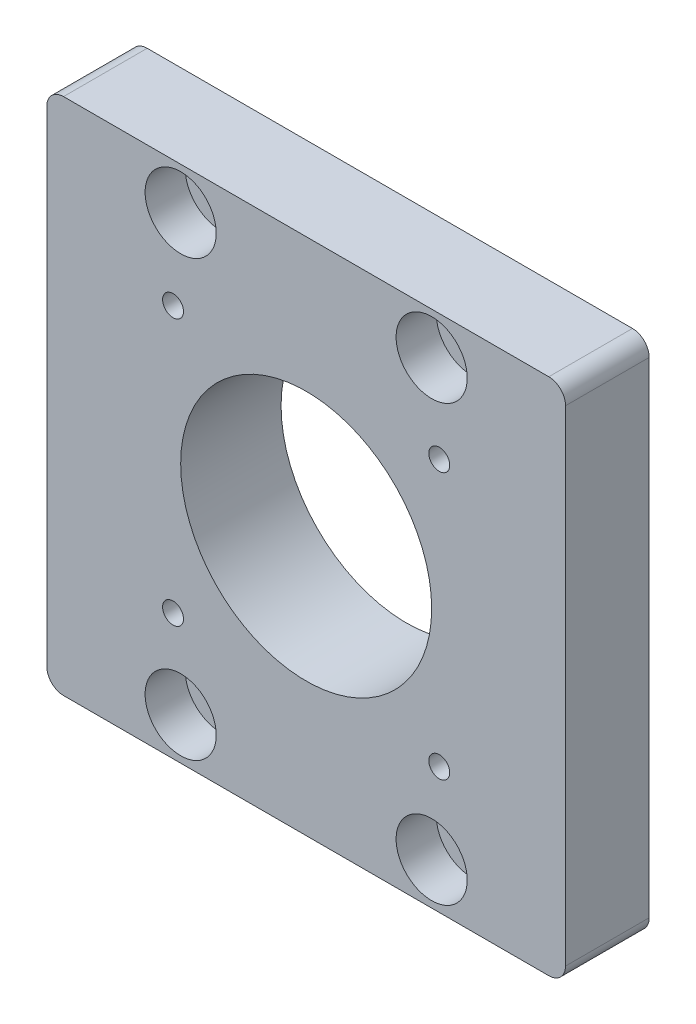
ISO-10303-21;
HEADER;
FILE_DESCRIPTION(('STEP AP214'),'2;1');
FILE_NAME('part.step','',(''),(''),'','','');
FILE_SCHEMA(('AUTOMOTIVE_DESIGN { 1 0 10303 214 1 1 1 1 }'));
ENDSEC;
DATA;
#1=APPLICATION_CONTEXT('core data for automotive mechanical design processes');
#2=APPLICATION_PROTOCOL_DEFINITION('international standard','automotive_design',2000,#1);
#3=PRODUCT_CONTEXT('',#1,'mechanical');
#4=PRODUCT('Part','Part','',(#3));
#5=PRODUCT_RELATED_PRODUCT_CATEGORY('part','',(#4));
#6=PRODUCT_DEFINITION_FORMATION('','',#4);
#7=PRODUCT_DEFINITION_CONTEXT('part definition',#1,'design');
#8=PRODUCT_DEFINITION('design','',#6,#7);
#9=PRODUCT_DEFINITION_SHAPE('','',#8);
#10=(LENGTH_UNIT() NAMED_UNIT(*) SI_UNIT(.MILLI.,.METRE.));
#11=(NAMED_UNIT(*) PLANE_ANGLE_UNIT() SI_UNIT($,.RADIAN.));
#12=(NAMED_UNIT(*) SI_UNIT($,.STERADIAN.) SOLID_ANGLE_UNIT());
#13=UNCERTAINTY_MEASURE_WITH_UNIT(LENGTH_MEASURE(1.E-05),#10,'distance_accuracy_value','');
#14=(GEOMETRIC_REPRESENTATION_CONTEXT(3) GLOBAL_UNCERTAINTY_ASSIGNED_CONTEXT((#13)) GLOBAL_UNIT_ASSIGNED_CONTEXT((#10,
#11,#12)) REPRESENTATION_CONTEXT('',''));
#15=CARTESIAN_POINT('',(0.,0.,0.));
#16=DIRECTION('',(0.,0.,1.));
#17=DIRECTION('',(1.,0.,0.));
#18=AXIS2_PLACEMENT_3D('',#15,#16,#17);
#19=CARTESIAN_POINT('',(0.,0.,0.));
#20=DIRECTION('',(0.,0.,-1.));
#21=DIRECTION('',(-1.,0.,0.));
#22=AXIS2_PLACEMENT_3D('',#19,#20,#21);
#23=PLANE('',#22);
#24=DIRECTION('',(0.,-1.,0.));
#25=VECTOR('',#24,1.);
#26=CARTESIAN_POINT('',(-31.,-31.,0.));
#27=LINE('',#26,#25);
#28=CARTESIAN_POINT('',(-31.,29.,0.));
#29=VERTEX_POINT('',#28);
#30=CARTESIAN_POINT('',(-31.,-29.,0.));
#31=VERTEX_POINT('',#30);
#32=EDGE_CURVE('E126',#29,#31,#27,.T.);
#33=ORIENTED_EDGE('',*,*,#32,.F.);
#34=CARTESIAN_POINT('',(-29.,29.,0.));
#35=DIRECTION('',(0.,0.,-1.));
#36=DIRECTION('',(-1.,0.,0.));
#37=AXIS2_PLACEMENT_3D('',#34,#35,#36);
#38=CIRCLE('',#37,2.);
#39=CARTESIAN_POINT('',(-29.,31.,0.));
#40=VERTEX_POINT('',#39);
#41=EDGE_CURVE('E108',#29,#40,#38,.T.);
#42=ORIENTED_EDGE('',*,*,#41,.T.);
#43=DIRECTION('',(-1.,0.,0.));
#44=VECTOR('',#43,1.);
#45=CARTESIAN_POINT('',(-31.,31.,0.));
#46=LINE('',#45,#44);
#47=CARTESIAN_POINT('',(29.,31.,0.));
#48=VERTEX_POINT('',#47);
#49=EDGE_CURVE('E137',#48,#40,#46,.T.);
#50=ORIENTED_EDGE('',*,*,#49,.F.);
#51=CARTESIAN_POINT('',(29.,29.,0.));
#52=DIRECTION('',(0.,0.,-1.));
#53=DIRECTION('',(-1.,0.,0.));
#54=AXIS2_PLACEMENT_3D('',#51,#52,#53);
#55=CIRCLE('',#54,2.);
#56=CARTESIAN_POINT('',(31.,29.,0.));
#57=VERTEX_POINT('',#56);
#58=EDGE_CURVE('E130',#48,#57,#55,.T.);
#59=ORIENTED_EDGE('',*,*,#58,.T.);
#60=DIRECTION('',(0.,1.,0.));
#61=VECTOR('',#60,1.);
#62=CARTESIAN_POINT('',(31.,-31.,0.));
#63=LINE('',#62,#61);
#64=CARTESIAN_POINT('',(31.,-29.,0.));
#65=VERTEX_POINT('',#64);
#66=EDGE_CURVE('E145',#65,#57,#63,.T.);
#67=ORIENTED_EDGE('',*,*,#66,.F.);
#68=CARTESIAN_POINT('',(29.,-29.,0.));
#69=DIRECTION('',(0.,0.,-1.));
#70=DIRECTION('',(-1.,0.,0.));
#71=AXIS2_PLACEMENT_3D('',#68,#69,#70);
#72=CIRCLE('',#71,2.);
#73=CARTESIAN_POINT('',(29.,-31.,0.));
#74=VERTEX_POINT('',#73);
#75=EDGE_CURVE('E178',#65,#74,#72,.T.);
#76=ORIENTED_EDGE('',*,*,#75,.T.);
#77=DIRECTION('',(1.,0.,0.));
#78=VECTOR('',#77,1.);
#79=CARTESIAN_POINT('',(-31.,-31.,0.));
#80=LINE('',#79,#78);
#81=CARTESIAN_POINT('',(-29.,-31.,0.));
#82=VERTEX_POINT('',#81);
#83=EDGE_CURVE('E136',#82,#74,#80,.T.);
#84=ORIENTED_EDGE('',*,*,#83,.F.);
#85=CARTESIAN_POINT('',(-29.,-29.,0.));
#86=DIRECTION('',(0.,0.,-1.));
#87=DIRECTION('',(-1.,0.,0.));
#88=AXIS2_PLACEMENT_3D('',#85,#86,#87);
#89=CIRCLE('',#88,2.);
#90=EDGE_CURVE('E120',#82,#31,#89,.T.);
#91=ORIENTED_EDGE('',*,*,#90,.T.);
#92=EDGE_LOOP('',(#33,#42,#50,#59,#67,#76,#84,#91));
#93=FACE_BOUND('',#92,.T.);
#94=CARTESIAN_POINT('',(-15.,25.9807621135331,0.));
#95=DIRECTION('',(0.,0.,1.));
#96=DIRECTION('',(1.,0.,0.));
#97=AXIS2_PLACEMENT_3D('',#94,#95,#96);
#98=CIRCLE('',#97,2.25);
#99=CARTESIAN_POINT('',(-12.75,25.9807621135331,0.));
#100=VERTEX_POINT('',#99);
#101=EDGE_CURVE('E267',#100,#100,#98,.T.);
#102=ORIENTED_EDGE('',*,*,#101,.T.);
#103=EDGE_LOOP('',(#102));
#104=FACE_BOUND('',#103,.T.);
#105=CARTESIAN_POINT('',(15.,25.9807621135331,0.));
#106=DIRECTION('',(0.,0.,1.));
#107=DIRECTION('',(1.,0.,0.));
#108=AXIS2_PLACEMENT_3D('',#105,#106,#107);
#109=CIRCLE('',#108,2.25);
#110=CARTESIAN_POINT('',(17.25,25.9807621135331,0.));
#111=VERTEX_POINT('',#110);
#112=EDGE_CURVE('E274',#111,#111,#109,.T.);
#113=ORIENTED_EDGE('',*,*,#112,.T.);
#114=EDGE_LOOP('',(#113));
#115=FACE_BOUND('',#114,.T.);
#116=CARTESIAN_POINT('',(15.,-25.9807621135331,0.));
#117=DIRECTION('',(0.,0.,1.));
#118=DIRECTION('',(1.,0.,0.));
#119=AXIS2_PLACEMENT_3D('',#116,#117,#118);
#120=CIRCLE('',#119,2.25);
#121=CARTESIAN_POINT('',(17.25,-25.9807621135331,0.));
#122=VERTEX_POINT('',#121);
#123=EDGE_CURVE('E278',#122,#122,#120,.T.);
#124=ORIENTED_EDGE('',*,*,#123,.T.);
#125=EDGE_LOOP('',(#124));
#126=FACE_BOUND('',#125,.T.);
#127=CARTESIAN_POINT('',(-15.,-25.9807621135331,0.));
#128=DIRECTION('',(0.,0.,1.));
#129=DIRECTION('',(1.,0.,0.));
#130=AXIS2_PLACEMENT_3D('',#127,#128,#129);
#131=CIRCLE('',#130,2.25);
#132=CARTESIAN_POINT('',(-12.75,-25.9807621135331,0.));
#133=VERTEX_POINT('',#132);
#134=EDGE_CURVE('E153',#133,#133,#131,.T.);
#135=ORIENTED_EDGE('',*,*,#134,.T.);
#136=EDGE_LOOP('',(#135));
#137=FACE_BOUND('',#136,.T.);
#138=CARTESIAN_POINT('',(0.,0.,0.));
#139=DIRECTION('',(0.,0.,-1.));
#140=DIRECTION('',(-1.,0.,0.));
#141=AXIS2_PLACEMENT_3D('',#138,#139,#140);
#142=CIRCLE('',#141,25.);
#143=CARTESIAN_POINT('',(-25.,0.,0.));
#144=VERTEX_POINT('',#143);
#145=EDGE_CURVE('E309',#144,#144,#142,.T.);
#146=ORIENTED_EDGE('',*,*,#145,.F.);
#147=EDGE_LOOP('',(#146));
#148=FACE_BOUND('',#147,.T.);
#149=ADVANCED_FACE('F40',(#93,#104,#115,#126,#137,#148),#23,.T.);
#150=CARTESIAN_POINT('',(-15.,-25.9807621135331,0.));
#151=DIRECTION('',(0.,0.,1.));
#152=DIRECTION('',(1.,0.,0.));
#153=AXIS2_PLACEMENT_3D('',#150,#151,#152);
#154=CYLINDRICAL_SURFACE('',#153,2.25);
#155=ORIENTED_EDGE('',*,*,#134,.F.);
#156=EDGE_LOOP('',(#155));
#157=FACE_BOUND('',#156,.T.);
#158=CARTESIAN_POINT('',(-15.,-25.9807621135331,5.2));
#159=DIRECTION('',(0.,0.,1.));
#160=DIRECTION('',(1.,0.,0.));
#161=AXIS2_PLACEMENT_3D('',#158,#159,#160);
#162=CIRCLE('',#161,2.25);
#163=CARTESIAN_POINT('',(-12.75,-25.9807621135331,5.2));
#164=VERTEX_POINT('',#163);
#165=EDGE_CURVE('E167',#164,#164,#162,.F.);
#166=ORIENTED_EDGE('',*,*,#165,.F.);
#167=EDGE_LOOP('',(#166));
#168=FACE_BOUND('',#167,.T.);
#169=ADVANCED_FACE('F340',(#157,#168),#154,.F.);
#170=CARTESIAN_POINT('',(15.,-25.9807621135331,0.));
#171=DIRECTION('',(0.,0.,1.));
#172=DIRECTION('',(1.,0.,0.));
#173=AXIS2_PLACEMENT_3D('',#170,#171,#172);
#174=CYLINDRICAL_SURFACE('',#173,2.25);
#175=ORIENTED_EDGE('',*,*,#123,.F.);
#176=EDGE_LOOP('',(#175));
#177=FACE_BOUND('',#176,.T.);
#178=CARTESIAN_POINT('',(15.,-25.9807621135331,5.2));
#179=DIRECTION('',(0.,0.,1.));
#180=DIRECTION('',(1.,0.,0.));
#181=AXIS2_PLACEMENT_3D('',#178,#179,#180);
#182=CIRCLE('',#181,2.25);
#183=CARTESIAN_POINT('',(17.25,-25.9807621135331,5.2));
#184=VERTEX_POINT('',#183);
#185=EDGE_CURVE('E161',#184,#184,#182,.F.);
#186=ORIENTED_EDGE('',*,*,#185,.F.);
#187=EDGE_LOOP('',(#186));
#188=FACE_BOUND('',#187,.T.);
#189=ADVANCED_FACE('F345',(#177,#188),#174,.F.);
#190=CARTESIAN_POINT('',(15.,25.9807621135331,0.));
#191=DIRECTION('',(0.,0.,1.));
#192=DIRECTION('',(1.,0.,0.));
#193=AXIS2_PLACEMENT_3D('',#190,#191,#192);
#194=CYLINDRICAL_SURFACE('',#193,2.25);
#195=ORIENTED_EDGE('',*,*,#112,.F.);
#196=EDGE_LOOP('',(#195));
#197=FACE_BOUND('',#196,.T.);
#198=CARTESIAN_POINT('',(15.,25.9807621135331,5.2));
#199=DIRECTION('',(0.,0.,1.));
#200=DIRECTION('',(1.,0.,0.));
#201=AXIS2_PLACEMENT_3D('',#198,#199,#200);
#202=CIRCLE('',#201,2.25);
#203=CARTESIAN_POINT('',(17.25,25.9807621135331,5.2));
#204=VERTEX_POINT('',#203);
#205=EDGE_CURVE('E155',#204,#204,#202,.F.);
#206=ORIENTED_EDGE('',*,*,#205,.F.);
#207=EDGE_LOOP('',(#206));
#208=FACE_BOUND('',#207,.T.);
#209=ADVANCED_FACE('F416',(#197,#208),#194,.F.);
#210=CARTESIAN_POINT('',(-15.,25.9807621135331,0.));
#211=DIRECTION('',(0.,0.,1.));
#212=DIRECTION('',(1.,0.,0.));
#213=AXIS2_PLACEMENT_3D('',#210,#211,#212);
#214=CYLINDRICAL_SURFACE('',#213,2.25);
#215=ORIENTED_EDGE('',*,*,#101,.F.);
#216=EDGE_LOOP('',(#215));
#217=FACE_BOUND('',#216,.T.);
#218=CARTESIAN_POINT('',(-15.,25.9807621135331,5.2));
#219=DIRECTION('',(0.,0.,1.));
#220=DIRECTION('',(1.,0.,0.));
#221=AXIS2_PLACEMENT_3D('',#218,#219,#220);
#222=CIRCLE('',#221,2.25);
#223=CARTESIAN_POINT('',(-12.75,25.9807621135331,5.2));
#224=VERTEX_POINT('',#223);
#225=EDGE_CURVE('E149',#224,#224,#222,.F.);
#226=ORIENTED_EDGE('',*,*,#225,.F.);
#227=EDGE_LOOP('',(#226));
#228=FACE_BOUND('',#227,.T.);
#229=ADVANCED_FACE('F420',(#217,#228),#214,.F.);
#230=CARTESIAN_POINT('',(0.,0.,10.));
#231=DIRECTION('',(0.,0.,-1.));
#232=DIRECTION('',(-1.,0.,0.));
#233=AXIS2_PLACEMENT_3D('',#230,#231,#232);
#234=PLANE('',#233);
#235=CARTESIAN_POINT('',(-15.,-25.9807621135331,10.));
#236=DIRECTION('',(0.,0.,1.));
#237=DIRECTION('',(1.,0.,0.));
#238=AXIS2_PLACEMENT_3D('',#235,#236,#237);
#239=CIRCLE('',#238,4.25);
#240=CARTESIAN_POINT('',(-10.75,-25.9807621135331,10.));
#241=VERTEX_POINT('',#240);
#242=EDGE_CURVE('E301',#241,#241,#239,.T.);
#243=ORIENTED_EDGE('',*,*,#242,.F.);
#244=EDGE_LOOP('',(#243));
#245=FACE_BOUND('',#244,.T.);
#246=CARTESIAN_POINT('',(15.,-25.9807621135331,10.));
#247=DIRECTION('',(0.,0.,1.));
#248=DIRECTION('',(1.,0.,0.));
#249=AXIS2_PLACEMENT_3D('',#246,#247,#248);
#250=CIRCLE('',#249,4.25);
#251=CARTESIAN_POINT('',(19.25,-25.9807621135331,10.));
#252=VERTEX_POINT('',#251);
#253=EDGE_CURVE('E171',#252,#252,#250,.T.);
#254=ORIENTED_EDGE('',*,*,#253,.F.);
#255=EDGE_LOOP('',(#254));
#256=FACE_BOUND('',#255,.T.);
#257=CARTESIAN_POINT('',(15.,25.9807621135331,10.));
#258=DIRECTION('',(0.,0.,1.));
#259=DIRECTION('',(1.,0.,0.));
#260=AXIS2_PLACEMENT_3D('',#257,#258,#259);
#261=CIRCLE('',#260,4.25);
#262=CARTESIAN_POINT('',(19.25,25.9807621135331,10.));
#263=VERTEX_POINT('',#262);
#264=EDGE_CURVE('E165',#263,#263,#261,.T.);
#265=ORIENTED_EDGE('',*,*,#264,.F.);
#266=EDGE_LOOP('',(#265));
#267=FACE_BOUND('',#266,.T.);
#268=CARTESIAN_POINT('',(-15.,25.9807621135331,10.));
#269=DIRECTION('',(0.,0.,1.));
#270=DIRECTION('',(1.,0.,0.));
#271=AXIS2_PLACEMENT_3D('',#268,#269,#270);
#272=CIRCLE('',#271,4.25);
#273=CARTESIAN_POINT('',(-10.75,25.9807621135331,10.));
#274=VERTEX_POINT('',#273);
#275=EDGE_CURVE('E159',#274,#274,#272,.T.);
#276=ORIENTED_EDGE('',*,*,#275,.F.);
#277=EDGE_LOOP('',(#276));
#278=FACE_BOUND('',#277,.T.);
#279=CARTESIAN_POINT('',(-15.9099025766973,-15.9099025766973,10.));
#280=DIRECTION('',(0.,0.,1.));
#281=DIRECTION('',(1.,0.,0.));
#282=AXIS2_PLACEMENT_3D('',#279,#280,#281);
#283=CIRCLE('',#282,1.25);
#284=CARTESIAN_POINT('',(-14.6599025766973,-15.9099025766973,10.));
#285=VERTEX_POINT('',#284);
#286=EDGE_CURVE('E263',#285,#285,#283,.T.);
#287=ORIENTED_EDGE('',*,*,#286,.F.);
#288=EDGE_LOOP('',(#287));
#289=FACE_BOUND('',#288,.T.);
#290=CARTESIAN_POINT('',(15.9099025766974,-15.9099025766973,10.));
#291=DIRECTION('',(0.,0.,1.));
#292=DIRECTION('',(1.,0.,0.));
#293=AXIS2_PLACEMENT_3D('',#290,#291,#292);
#294=CIRCLE('',#293,1.25);
#295=CARTESIAN_POINT('',(17.1599025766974,-15.9099025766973,10.));
#296=VERTEX_POINT('',#295);
#297=EDGE_CURVE('E255',#296,#296,#294,.T.);
#298=ORIENTED_EDGE('',*,*,#297,.F.);
#299=EDGE_LOOP('',(#298));
#300=FACE_BOUND('',#299,.T.);
#301=CARTESIAN_POINT('',(15.9099025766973,15.9099025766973,10.));
#302=DIRECTION('',(0.,0.,1.));
#303=DIRECTION('',(1.,0.,0.));
#304=AXIS2_PLACEMENT_3D('',#301,#302,#303);
#305=CIRCLE('',#304,1.25);
#306=CARTESIAN_POINT('',(17.1599025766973,15.9099025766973,10.));
#307=VERTEX_POINT('',#306);
#308=EDGE_CURVE('E248',#307,#307,#305,.T.);
#309=ORIENTED_EDGE('',*,*,#308,.F.);
#310=EDGE_LOOP('',(#309));
#311=FACE_BOUND('',#310,.T.);
#312=CARTESIAN_POINT('',(-15.9099025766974,15.9099025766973,10.));
#313=DIRECTION('',(0.,0.,1.));
#314=DIRECTION('',(1.,0.,0.));
#315=AXIS2_PLACEMENT_3D('',#312,#313,#314);
#316=CIRCLE('',#315,1.25);
#317=CARTESIAN_POINT('',(-14.6599025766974,15.9099025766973,10.));
#318=VERTEX_POINT('',#317);
#319=EDGE_CURVE('E240',#318,#318,#316,.T.);
#320=ORIENTED_EDGE('',*,*,#319,.F.);
#321=EDGE_LOOP('',(#320));
#322=FACE_BOUND('',#321,.T.);
#323=DIRECTION('',(-1.,0.,0.));
#324=VECTOR('',#323,1.);
#325=CARTESIAN_POINT('',(-31.,31.,10.));
#326=LINE('',#325,#324);
#327=CARTESIAN_POINT('',(29.,31.,10.));
#328=VERTEX_POINT('',#327);
#329=CARTESIAN_POINT('',(-29.,31.,10.));
#330=VERTEX_POINT('',#329);
#331=EDGE_CURVE('E223',#328,#330,#326,.T.);
#332=ORIENTED_EDGE('',*,*,#331,.T.);
#333=CARTESIAN_POINT('',(-29.,29.,10.));
#334=DIRECTION('',(0.,0.,-1.));
#335=DIRECTION('',(-1.,0.,0.));
#336=AXIS2_PLACEMENT_3D('',#333,#334,#335);
#337=CIRCLE('',#336,2.);
#338=CARTESIAN_POINT('',(-31.,29.,10.));
#339=VERTEX_POINT('',#338);
#340=EDGE_CURVE('E196',#330,#339,#337,.F.);
#341=ORIENTED_EDGE('',*,*,#340,.T.);
#342=DIRECTION('',(0.,-1.,0.));
#343=VECTOR('',#342,1.);
#344=CARTESIAN_POINT('',(-31.,-31.,10.));
#345=LINE('',#344,#343);
#346=CARTESIAN_POINT('',(-31.,-29.,10.));
#347=VERTEX_POINT('',#346);
#348=EDGE_CURVE('E128',#339,#347,#345,.T.);
#349=ORIENTED_EDGE('',*,*,#348,.T.);
#350=CARTESIAN_POINT('',(-29.,-29.,10.));
#351=DIRECTION('',(0.,0.,-1.));
#352=DIRECTION('',(-1.,0.,0.));
#353=AXIS2_PLACEMENT_3D('',#350,#351,#352);
#354=CIRCLE('',#353,2.);
#355=CARTESIAN_POINT('',(-29.,-31.,10.));
#356=VERTEX_POINT('',#355);
#357=EDGE_CURVE('E63',#347,#356,#354,.F.);
#358=ORIENTED_EDGE('',*,*,#357,.T.);
#359=DIRECTION('',(1.,0.,0.));
#360=VECTOR('',#359,1.);
#361=CARTESIAN_POINT('',(-31.,-31.,10.));
#362=LINE('',#361,#360);
#363=CARTESIAN_POINT('',(29.,-31.,10.));
#364=VERTEX_POINT('',#363);
#365=EDGE_CURVE('E174',#356,#364,#362,.T.);
#366=ORIENTED_EDGE('',*,*,#365,.T.);
#367=CARTESIAN_POINT('',(29.,-29.,10.));
#368=DIRECTION('',(0.,0.,-1.));
#369=DIRECTION('',(-1.,0.,0.));
#370=AXIS2_PLACEMENT_3D('',#367,#368,#369);
#371=CIRCLE('',#370,2.);
#372=CARTESIAN_POINT('',(31.,-29.,10.));
#373=VERTEX_POINT('',#372);
#374=EDGE_CURVE('E191',#364,#373,#371,.F.);
#375=ORIENTED_EDGE('',*,*,#374,.T.);
#376=DIRECTION('',(0.,1.,0.));
#377=VECTOR('',#376,1.);
#378=CARTESIAN_POINT('',(31.,-31.,10.));
#379=LINE('',#378,#377);
#380=CARTESIAN_POINT('',(31.,29.,10.));
#381=VERTEX_POINT('',#380);
#382=EDGE_CURVE('E142',#373,#381,#379,.T.);
#383=ORIENTED_EDGE('',*,*,#382,.T.);
#384=CARTESIAN_POINT('',(29.,29.,10.));
#385=DIRECTION('',(0.,0.,-1.));
#386=DIRECTION('',(-1.,0.,0.));
#387=AXIS2_PLACEMENT_3D('',#384,#385,#386);
#388=CIRCLE('',#387,2.);
#389=EDGE_CURVE('E188',#381,#328,#388,.F.);
#390=ORIENTED_EDGE('',*,*,#389,.T.);
#391=EDGE_LOOP('',(#332,#341,#349,#358,#366,#375,#383,#390));
#392=FACE_BOUND('',#391,.T.);
#393=CARTESIAN_POINT('',(0.,0.,10.));
#394=DIRECTION('',(0.,0.,1.));
#395=DIRECTION('',(1.,0.,0.));
#396=AXIS2_PLACEMENT_3D('',#393,#394,#395);
#397=CIRCLE('',#396,15.);
#398=CARTESIAN_POINT('',(15.,0.,10.));
#399=VERTEX_POINT('',#398);
#400=EDGE_CURVE('E229',#399,#399,#397,.T.);
#401=ORIENTED_EDGE('',*,*,#400,.F.);
#402=EDGE_LOOP('',(#401));
#403=FACE_BOUND('',#402,.T.);
#404=ADVANCED_FACE('F218',(#245,#256,#267,#278,#289,#300,#311,#322,#392,#403),#234,.F.);
#405=CARTESIAN_POINT('',(31.,-31.,10.));
#406=DIRECTION('',(-1.,0.,0.));
#407=DIRECTION('',(0.,0.,1.));
#408=AXIS2_PLACEMENT_3D('',#405,#406,#407);
#409=PLANE('',#408);
#410=ORIENTED_EDGE('',*,*,#382,.F.);
#411=DIRECTION('',(0.,0.,-1.));
#412=VECTOR('',#411,1.);
#413=CARTESIAN_POINT('',(31.,-29.,10.));
#414=LINE('',#413,#412);
#415=EDGE_CURVE('E11',#373,#65,#414,.T.);
#416=ORIENTED_EDGE('',*,*,#415,.T.);
#417=ORIENTED_EDGE('',*,*,#66,.T.);
#418=DIRECTION('',(0.,0.,-1.));
#419=VECTOR('',#418,1.);
#420=CARTESIAN_POINT('',(31.,29.,10.));
#421=LINE('',#420,#419);
#422=EDGE_CURVE('E49',#57,#381,#421,.F.);
#423=ORIENTED_EDGE('',*,*,#422,.T.);
#424=EDGE_LOOP('',(#410,#416,#417,#423));
#425=FACE_BOUND('',#424,.T.);
#426=ADVANCED_FACE('F212',(#425),#409,.F.);
#427=CARTESIAN_POINT('',(-31.,31.,10.));
#428=DIRECTION('',(0.,-1.,0.));
#429=DIRECTION('',(0.,0.,-1.));
#430=AXIS2_PLACEMENT_3D('',#427,#428,#429);
#431=PLANE('',#430);
#432=ORIENTED_EDGE('',*,*,#49,.T.);
#433=DIRECTION('',(0.,0.,-1.));
#434=VECTOR('',#433,1.);
#435=CARTESIAN_POINT('',(-29.,31.,10.));
#436=LINE('',#435,#434);
#437=EDGE_CURVE('E113',#40,#330,#436,.F.);
#438=ORIENTED_EDGE('',*,*,#437,.T.);
#439=ORIENTED_EDGE('',*,*,#331,.F.);
#440=DIRECTION('',(0.,0.,-1.));
#441=VECTOR('',#440,1.);
#442=CARTESIAN_POINT('',(29.,31.,10.));
#443=LINE('',#442,#441);
#444=EDGE_CURVE('E119',#328,#48,#443,.T.);
#445=ORIENTED_EDGE('',*,*,#444,.T.);
#446=EDGE_LOOP('',(#432,#438,#439,#445));
#447=FACE_BOUND('',#446,.T.);
#448=ADVANCED_FACE('F227',(#447),#431,.F.);
#449=CARTESIAN_POINT('',(-31.,-31.,10.));
#450=DIRECTION('',(1.,0.,0.));
#451=DIRECTION('',(0.,0.,-1.));
#452=AXIS2_PLACEMENT_3D('',#449,#450,#451);
#453=PLANE('',#452);
#454=ORIENTED_EDGE('',*,*,#348,.F.);
#455=DIRECTION('',(0.,0.,-1.));
#456=VECTOR('',#455,1.);
#457=CARTESIAN_POINT('',(-31.,29.,10.));
#458=LINE('',#457,#456);
#459=EDGE_CURVE('E112',#339,#29,#458,.T.);
#460=ORIENTED_EDGE('',*,*,#459,.T.);
#461=ORIENTED_EDGE('',*,*,#32,.T.);
#462=DIRECTION('',(0.,0.,-1.));
#463=VECTOR('',#462,1.);
#464=CARTESIAN_POINT('',(-31.,-29.,10.));
#465=LINE('',#464,#463);
#466=EDGE_CURVE('E131',#31,#347,#465,.F.);
#467=ORIENTED_EDGE('',*,*,#466,.T.);
#468=EDGE_LOOP('',(#454,#460,#461,#467));
#469=FACE_BOUND('',#468,.T.);
#470=ADVANCED_FACE('F125',(#469),#453,.F.);
#471=CARTESIAN_POINT('',(-31.,-31.,10.));
#472=DIRECTION('',(0.,1.,0.));
#473=DIRECTION('',(0.,0.,1.));
#474=AXIS2_PLACEMENT_3D('',#471,#472,#473);
#475=PLANE('',#474);
#476=ORIENTED_EDGE('',*,*,#365,.F.);
#477=DIRECTION('',(0.,0.,-1.));
#478=VECTOR('',#477,1.);
#479=CARTESIAN_POINT('',(-29.,-31.,10.));
#480=LINE('',#479,#478);
#481=EDGE_CURVE('E201',#356,#82,#480,.T.);
#482=ORIENTED_EDGE('',*,*,#481,.T.);
#483=ORIENTED_EDGE('',*,*,#83,.T.);
#484=DIRECTION('',(0.,0.,-1.));
#485=VECTOR('',#484,1.);
#486=CARTESIAN_POINT('',(29.,-31.,10.));
#487=LINE('',#486,#485);
#488=EDGE_CURVE('E56',#74,#364,#487,.F.);
#489=ORIENTED_EDGE('',*,*,#488,.T.);
#490=EDGE_LOOP('',(#476,#482,#483,#489));
#491=FACE_BOUND('',#490,.T.);
#492=ADVANCED_FACE('F351',(#491),#475,.F.);
#493=CARTESIAN_POINT('',(0.,0.,10.));
#494=DIRECTION('',(0.,0.,-1.));
#495=DIRECTION('',(-1.,0.,0.));
#496=AXIS2_PLACEMENT_3D('',#493,#494,#495);
#497=CYLINDRICAL_SURFACE('',#496,15.);
#498=ORIENTED_EDGE('',*,*,#400,.T.);
#499=EDGE_LOOP('',(#498));
#500=FACE_BOUND('',#499,.T.);
#501=CARTESIAN_POINT('',(0.,0.,-2.));
#502=DIRECTION('',(0.,0.,-1.));
#503=DIRECTION('',(-1.,0.,0.));
#504=AXIS2_PLACEMENT_3D('',#501,#502,#503);
#505=CIRCLE('',#504,15.);
#506=CARTESIAN_POINT('',(-15.,0.,-2.));
#507=VERTEX_POINT('',#506);
#508=EDGE_CURVE('E313',#507,#507,#505,.T.);
#509=ORIENTED_EDGE('',*,*,#508,.T.);
#510=EDGE_LOOP('',(#509));
#511=FACE_BOUND('',#510,.T.);
#512=ADVANCED_FACE('F321',(#500,#511),#497,.F.);
#513=CARTESIAN_POINT('',(-15.9099025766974,15.9099025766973,0.));
#514=DIRECTION('',(0.,0.,1.));
#515=DIRECTION('',(1.,0.,0.));
#516=AXIS2_PLACEMENT_3D('',#513,#514,#515);
#517=CYLINDRICAL_SURFACE('',#516,1.25);
#518=CARTESIAN_POINT('',(-15.9099025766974,15.9099025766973,0.));
#519=DIRECTION('',(0.,0.,1.));
#520=DIRECTION('',(1.,0.,0.));
#521=AXIS2_PLACEMENT_3D('',#518,#519,#520);
#522=CIRCLE('',#521,1.25);
#523=CARTESIAN_POINT('',(-14.6599025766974,15.9099025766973,0.));
#524=VERTEX_POINT('',#523);
#525=EDGE_CURVE('E232',#524,#524,#522,.T.);
#526=ORIENTED_EDGE('',*,*,#525,.F.);
#527=EDGE_LOOP('',(#526));
#528=FACE_BOUND('',#527,.T.);
#529=ORIENTED_EDGE('',*,*,#319,.T.);
#530=EDGE_LOOP('',(#529));
#531=FACE_BOUND('',#530,.T.);
#532=ADVANCED_FACE('F435',(#528,#531),#517,.F.);
#533=CARTESIAN_POINT('',(15.9099025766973,15.9099025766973,0.));
#534=DIRECTION('',(0.,0.,1.));
#535=DIRECTION('',(1.,0.,0.));
#536=AXIS2_PLACEMENT_3D('',#533,#534,#535);
#537=CYLINDRICAL_SURFACE('',#536,1.25);
#538=CARTESIAN_POINT('',(15.9099025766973,15.9099025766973,0.));
#539=DIRECTION('',(0.,0.,1.));
#540=DIRECTION('',(1.,0.,0.));
#541=AXIS2_PLACEMENT_3D('',#538,#539,#540);
#542=CIRCLE('',#541,1.25);
#543=CARTESIAN_POINT('',(17.1599025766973,15.9099025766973,0.));
#544=VERTEX_POINT('',#543);
#545=EDGE_CURVE('E244',#544,#544,#542,.T.);
#546=ORIENTED_EDGE('',*,*,#545,.F.);
#547=EDGE_LOOP('',(#546));
#548=FACE_BOUND('',#547,.T.);
#549=ORIENTED_EDGE('',*,*,#308,.T.);
#550=EDGE_LOOP('',(#549));
#551=FACE_BOUND('',#550,.T.);
#552=ADVANCED_FACE('F431',(#548,#551),#537,.F.);
#553=CARTESIAN_POINT('',(15.9099025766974,-15.9099025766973,0.));
#554=DIRECTION('',(0.,0.,1.));
#555=DIRECTION('',(1.,0.,0.));
#556=AXIS2_PLACEMENT_3D('',#553,#554,#555);
#557=CYLINDRICAL_SURFACE('',#556,1.25);
#558=CARTESIAN_POINT('',(15.9099025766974,-15.9099025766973,0.));
#559=DIRECTION('',(0.,0.,1.));
#560=DIRECTION('',(1.,0.,0.));
#561=AXIS2_PLACEMENT_3D('',#558,#559,#560);
#562=CIRCLE('',#561,1.25);
#563=CARTESIAN_POINT('',(17.1599025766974,-15.9099025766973,0.));
#564=VERTEX_POINT('',#563);
#565=EDGE_CURVE('E251',#564,#564,#562,.T.);
#566=ORIENTED_EDGE('',*,*,#565,.F.);
#567=EDGE_LOOP('',(#566));
#568=FACE_BOUND('',#567,.T.);
#569=ORIENTED_EDGE('',*,*,#297,.T.);
#570=EDGE_LOOP('',(#569));
#571=FACE_BOUND('',#570,.T.);
#572=ADVANCED_FACE('F427',(#568,#571),#557,.F.);
#573=CARTESIAN_POINT('',(-15.9099025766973,-15.9099025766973,0.));
#574=DIRECTION('',(0.,0.,1.));
#575=DIRECTION('',(1.,0.,0.));
#576=AXIS2_PLACEMENT_3D('',#573,#574,#575);
#577=CYLINDRICAL_SURFACE('',#576,1.25);
#578=CARTESIAN_POINT('',(-15.9099025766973,-15.9099025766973,0.));
#579=DIRECTION('',(0.,0.,1.));
#580=DIRECTION('',(1.,0.,0.));
#581=AXIS2_PLACEMENT_3D('',#578,#579,#580);
#582=CIRCLE('',#581,1.25);
#583=CARTESIAN_POINT('',(-14.6599025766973,-15.9099025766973,0.));
#584=VERTEX_POINT('',#583);
#585=EDGE_CURVE('E259',#584,#584,#582,.T.);
#586=ORIENTED_EDGE('',*,*,#585,.F.);
#587=EDGE_LOOP('',(#586));
#588=FACE_BOUND('',#587,.T.);
#589=ORIENTED_EDGE('',*,*,#286,.T.);
#590=EDGE_LOOP('',(#589));
#591=FACE_BOUND('',#590,.T.);
#592=ADVANCED_FACE('F409',(#588,#591),#577,.F.);
#593=CARTESIAN_POINT('',(-15.,25.9807621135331,5.2));
#594=DIRECTION('',(0.,0.,1.));
#595=DIRECTION('',(1.,0.,0.));
#596=AXIS2_PLACEMENT_3D('',#593,#594,#595);
#597=PLANE('',#596);
#598=CARTESIAN_POINT('',(-15.,25.9807621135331,5.2));
#599=DIRECTION('',(0.,0.,1.));
#600=DIRECTION('',(1.,0.,0.));
#601=AXIS2_PLACEMENT_3D('',#598,#599,#600);
#602=CIRCLE('',#601,4.25);
#603=CARTESIAN_POINT('',(-10.75,25.9807621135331,5.2));
#604=VERTEX_POINT('',#603);
#605=EDGE_CURVE('E154',#604,#604,#602,.T.);
#606=ORIENTED_EDGE('',*,*,#605,.T.);
#607=EDGE_LOOP('',(#606));
#608=FACE_BOUND('',#607,.T.);
#609=ORIENTED_EDGE('',*,*,#225,.T.);
#610=EDGE_LOOP('',(#609));
#611=FACE_BOUND('',#610,.T.);
#612=ADVANCED_FACE('F406',(#608,#611),#597,.T.);
#613=CARTESIAN_POINT('',(-15.,25.9807621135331,5.2));
#614=DIRECTION('',(0.,0.,1.));
#615=DIRECTION('',(1.,0.,0.));
#616=AXIS2_PLACEMENT_3D('',#613,#614,#615);
#617=CYLINDRICAL_SURFACE('',#616,4.25);
#618=ORIENTED_EDGE('',*,*,#605,.F.);
#619=EDGE_LOOP('',(#618));
#620=FACE_BOUND('',#619,.T.);
#621=ORIENTED_EDGE('',*,*,#275,.T.);
#622=EDGE_LOOP('',(#621));
#623=FACE_BOUND('',#622,.T.);
#624=ADVANCED_FACE('F401',(#620,#623),#617,.F.);
#625=CARTESIAN_POINT('',(15.,25.9807621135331,5.2));
#626=DIRECTION('',(0.,0.,1.));
#627=DIRECTION('',(1.,0.,0.));
#628=AXIS2_PLACEMENT_3D('',#625,#626,#627);
#629=PLANE('',#628);
#630=CARTESIAN_POINT('',(15.,25.9807621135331,5.2));
#631=DIRECTION('',(0.,0.,1.));
#632=DIRECTION('',(1.,0.,0.));
#633=AXIS2_PLACEMENT_3D('',#630,#631,#632);
#634=CIRCLE('',#633,4.25);
#635=CARTESIAN_POINT('',(19.25,25.9807621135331,5.2));
#636=VERTEX_POINT('',#635);
#637=EDGE_CURVE('E160',#636,#636,#634,.T.);
#638=ORIENTED_EDGE('',*,*,#637,.T.);
#639=EDGE_LOOP('',(#638));
#640=FACE_BOUND('',#639,.T.);
#641=ORIENTED_EDGE('',*,*,#205,.T.);
#642=EDGE_LOOP('',(#641));
#643=FACE_BOUND('',#642,.T.);
#644=ADVANCED_FACE('F398',(#640,#643),#629,.T.);
#645=CARTESIAN_POINT('',(15.,25.9807621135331,5.2));
#646=DIRECTION('',(0.,0.,1.));
#647=DIRECTION('',(1.,0.,0.));
#648=AXIS2_PLACEMENT_3D('',#645,#646,#647);
#649=CYLINDRICAL_SURFACE('',#648,4.25);
#650=ORIENTED_EDGE('',*,*,#637,.F.);
#651=EDGE_LOOP('',(#650));
#652=FACE_BOUND('',#651,.T.);
#653=ORIENTED_EDGE('',*,*,#264,.T.);
#654=EDGE_LOOP('',(#653));
#655=FACE_BOUND('',#654,.T.);
#656=ADVANCED_FACE('F393',(#652,#655),#649,.F.);
#657=CARTESIAN_POINT('',(15.,-25.9807621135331,5.2));
#658=DIRECTION('',(0.,0.,1.));
#659=DIRECTION('',(1.,0.,0.));
#660=AXIS2_PLACEMENT_3D('',#657,#658,#659);
#661=PLANE('',#660);
#662=CARTESIAN_POINT('',(15.,-25.9807621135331,5.2));
#663=DIRECTION('',(0.,0.,1.));
#664=DIRECTION('',(1.,0.,0.));
#665=AXIS2_PLACEMENT_3D('',#662,#663,#664);
#666=CIRCLE('',#665,4.25);
#667=CARTESIAN_POINT('',(19.25,-25.9807621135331,5.2));
#668=VERTEX_POINT('',#667);
#669=EDGE_CURVE('E166',#668,#668,#666,.T.);
#670=ORIENTED_EDGE('',*,*,#669,.T.);
#671=EDGE_LOOP('',(#670));
#672=FACE_BOUND('',#671,.T.);
#673=ORIENTED_EDGE('',*,*,#185,.T.);
#674=EDGE_LOOP('',(#673));
#675=FACE_BOUND('',#674,.T.);
#676=ADVANCED_FACE('F390',(#672,#675),#661,.T.);
#677=CARTESIAN_POINT('',(15.,-25.9807621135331,5.2));
#678=DIRECTION('',(0.,0.,1.));
#679=DIRECTION('',(1.,0.,0.));
#680=AXIS2_PLACEMENT_3D('',#677,#678,#679);
#681=CYLINDRICAL_SURFACE('',#680,4.25);
#682=ORIENTED_EDGE('',*,*,#669,.F.);
#683=EDGE_LOOP('',(#682));
#684=FACE_BOUND('',#683,.T.);
#685=ORIENTED_EDGE('',*,*,#253,.T.);
#686=EDGE_LOOP('',(#685));
#687=FACE_BOUND('',#686,.T.);
#688=ADVANCED_FACE('F385',(#684,#687),#681,.F.);
#689=CARTESIAN_POINT('',(-15.,-25.9807621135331,5.2));
#690=DIRECTION('',(0.,0.,1.));
#691=DIRECTION('',(1.,0.,0.));
#692=AXIS2_PLACEMENT_3D('',#689,#690,#691);
#693=PLANE('',#692);
#694=CARTESIAN_POINT('',(-15.,-25.9807621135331,5.2));
#695=DIRECTION('',(0.,0.,1.));
#696=DIRECTION('',(1.,0.,0.));
#697=AXIS2_PLACEMENT_3D('',#694,#695,#696);
#698=CIRCLE('',#697,4.25);
#699=CARTESIAN_POINT('',(-10.75,-25.9807621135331,5.2));
#700=VERTEX_POINT('',#699);
#701=EDGE_CURVE('E172',#700,#700,#698,.T.);
#702=ORIENTED_EDGE('',*,*,#701,.T.);
#703=EDGE_LOOP('',(#702));
#704=FACE_BOUND('',#703,.T.);
#705=ORIENTED_EDGE('',*,*,#165,.T.);
#706=EDGE_LOOP('',(#705));
#707=FACE_BOUND('',#706,.T.);
#708=ADVANCED_FACE('F382',(#704,#707),#693,.T.);
#709=CARTESIAN_POINT('',(-15.,-25.9807621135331,5.2));
#710=DIRECTION('',(0.,0.,1.));
#711=DIRECTION('',(1.,0.,0.));
#712=AXIS2_PLACEMENT_3D('',#709,#710,#711);
#713=CYLINDRICAL_SURFACE('',#712,4.25);
#714=ORIENTED_EDGE('',*,*,#701,.F.);
#715=EDGE_LOOP('',(#714));
#716=FACE_BOUND('',#715,.T.);
#717=ORIENTED_EDGE('',*,*,#242,.T.);
#718=EDGE_LOOP('',(#717));
#719=FACE_BOUND('',#718,.T.);
#720=ADVANCED_FACE('F363',(#716,#719),#713,.F.);
#721=CARTESIAN_POINT('',(-29.,29.,10.));
#722=DIRECTION('',(0.,0.,-1.));
#723=DIRECTION('',(-1.,0.,0.));
#724=AXIS2_PLACEMENT_3D('',#721,#722,#723);
#725=CYLINDRICAL_SURFACE('',#724,2.);
#726=ORIENTED_EDGE('',*,*,#340,.F.);
#727=ORIENTED_EDGE('',*,*,#437,.F.);
#728=ORIENTED_EDGE('',*,*,#41,.F.);
#729=ORIENTED_EDGE('',*,*,#459,.F.);
#730=EDGE_LOOP('',(#726,#727,#728,#729));
#731=FACE_BOUND('',#730,.T.);
#732=ADVANCED_FACE('F111',(#731),#725,.T.);
#733=CARTESIAN_POINT('',(-29.,-29.,10.));
#734=DIRECTION('',(0.,0.,-1.));
#735=DIRECTION('',(-1.,0.,0.));
#736=AXIS2_PLACEMENT_3D('',#733,#734,#735);
#737=CYLINDRICAL_SURFACE('',#736,2.);
#738=ORIENTED_EDGE('',*,*,#357,.F.);
#739=ORIENTED_EDGE('',*,*,#466,.F.);
#740=ORIENTED_EDGE('',*,*,#90,.F.);
#741=ORIENTED_EDGE('',*,*,#481,.F.);
#742=EDGE_LOOP('',(#738,#739,#740,#741));
#743=FACE_BOUND('',#742,.T.);
#744=ADVANCED_FACE('F362',(#743),#737,.T.);
#745=CARTESIAN_POINT('',(29.,-29.,10.));
#746=DIRECTION('',(0.,0.,-1.));
#747=DIRECTION('',(-1.,0.,0.));
#748=AXIS2_PLACEMENT_3D('',#745,#746,#747);
#749=CYLINDRICAL_SURFACE('',#748,2.);
#750=ORIENTED_EDGE('',*,*,#374,.F.);
#751=ORIENTED_EDGE('',*,*,#488,.F.);
#752=ORIENTED_EDGE('',*,*,#75,.F.);
#753=ORIENTED_EDGE('',*,*,#415,.F.);
#754=EDGE_LOOP('',(#750,#751,#752,#753));
#755=FACE_BOUND('',#754,.T.);
#756=ADVANCED_FACE('F365',(#755),#749,.T.);
#757=CARTESIAN_POINT('',(29.,29.,10.));
#758=DIRECTION('',(0.,0.,-1.));
#759=DIRECTION('',(-1.,0.,0.));
#760=AXIS2_PLACEMENT_3D('',#757,#758,#759);
#761=CYLINDRICAL_SURFACE('',#760,2.);
#762=ORIENTED_EDGE('',*,*,#389,.F.);
#763=ORIENTED_EDGE('',*,*,#422,.F.);
#764=ORIENTED_EDGE('',*,*,#58,.F.);
#765=ORIENTED_EDGE('',*,*,#444,.F.);
#766=EDGE_LOOP('',(#762,#763,#764,#765));
#767=FACE_BOUND('',#766,.T.);
#768=ADVANCED_FACE('F42',(#767),#761,.T.);
#769=CARTESIAN_POINT('',(0.,0.,0.));
#770=DIRECTION('',(0.,0.,-1.));
#771=DIRECTION('',(-1.,0.,0.));
#772=AXIS2_PLACEMENT_3D('',#769,#770,#771);
#773=PLANE('',#772);
#774=ORIENTED_EDGE('',*,*,#585,.T.);
#775=EDGE_LOOP('',(#774));
#776=FACE_BOUND('',#775,.T.);
#777=ADVANCED_FACE('F338',(#776),#773,.F.);
#778=ORIENTED_EDGE('',*,*,#565,.T.);
#779=EDGE_LOOP('',(#778));
#780=FACE_BOUND('',#779,.T.);
#781=ADVANCED_FACE('F375',(#780),#773,.F.);
#782=ORIENTED_EDGE('',*,*,#545,.T.);
#783=EDGE_LOOP('',(#782));
#784=FACE_BOUND('',#783,.T.);
#785=ADVANCED_FACE('F335',(#784),#773,.F.);
#786=ORIENTED_EDGE('',*,*,#525,.T.);
#787=EDGE_LOOP('',(#786));
#788=FACE_BOUND('',#787,.T.);
#789=ADVANCED_FACE('F326',(#788),#773,.F.);
#790=CARTESIAN_POINT('',(0.,0.,-2.));
#791=DIRECTION('',(0.,0.,-1.));
#792=DIRECTION('',(-1.,0.,0.));
#793=AXIS2_PLACEMENT_3D('',#790,#791,#792);
#794=PLANE('',#793);
#795=CARTESIAN_POINT('',(0.,0.,-2.));
#796=DIRECTION('',(0.,0.,-1.));
#797=DIRECTION('',(-1.,0.,0.));
#798=AXIS2_PLACEMENT_3D('',#795,#796,#797);
#799=CIRCLE('',#798,25.);
#800=CARTESIAN_POINT('',(-25.,0.,-2.));
#801=VERTEX_POINT('',#800);
#802=EDGE_CURVE('E305',#801,#801,#799,.T.);
#803=ORIENTED_EDGE('',*,*,#802,.T.);
#804=EDGE_LOOP('',(#803));
#805=FACE_BOUND('',#804,.T.);
#806=ORIENTED_EDGE('',*,*,#508,.F.);
#807=EDGE_LOOP('',(#806));
#808=FACE_BOUND('',#807,.T.);
#809=ADVANCED_FACE('F323',(#805,#808),#794,.T.);
#810=CARTESIAN_POINT('',(0.,0.,-2.));
#811=DIRECTION('',(0.,0.,1.));
#812=DIRECTION('',(1.,0.,0.));
#813=AXIS2_PLACEMENT_3D('',#810,#811,#812);
#814=CYLINDRICAL_SURFACE('',#813,25.);
#815=ORIENTED_EDGE('',*,*,#802,.F.);
#816=EDGE_LOOP('',(#815));
#817=FACE_BOUND('',#816,.T.);
#818=ORIENTED_EDGE('',*,*,#145,.T.);
#819=EDGE_LOOP('',(#818));
#820=FACE_BOUND('',#819,.T.);
#821=ADVANCED_FACE('F325',(#817,#820),#814,.T.);
#822=CLOSED_SHELL('',(#149,#169,#189,#209,#229,#404,#426,#448,#470,#492,#512,#532,#552,#572,
#592,#612,#624,#644,#656,#676,#688,#708,#720,#732,#744,#756,#768,#777,#781,#785,#789,#809,#821));
#823=MANIFOLD_SOLID_BREP('B2',#822);
#824=ADVANCED_BREP_SHAPE_REPRESENTATION('',(#18,#823),#14);
#825=SHAPE_DEFINITION_REPRESENTATION(#9,#824);
ENDSEC;
END-ISO-10303-21;
